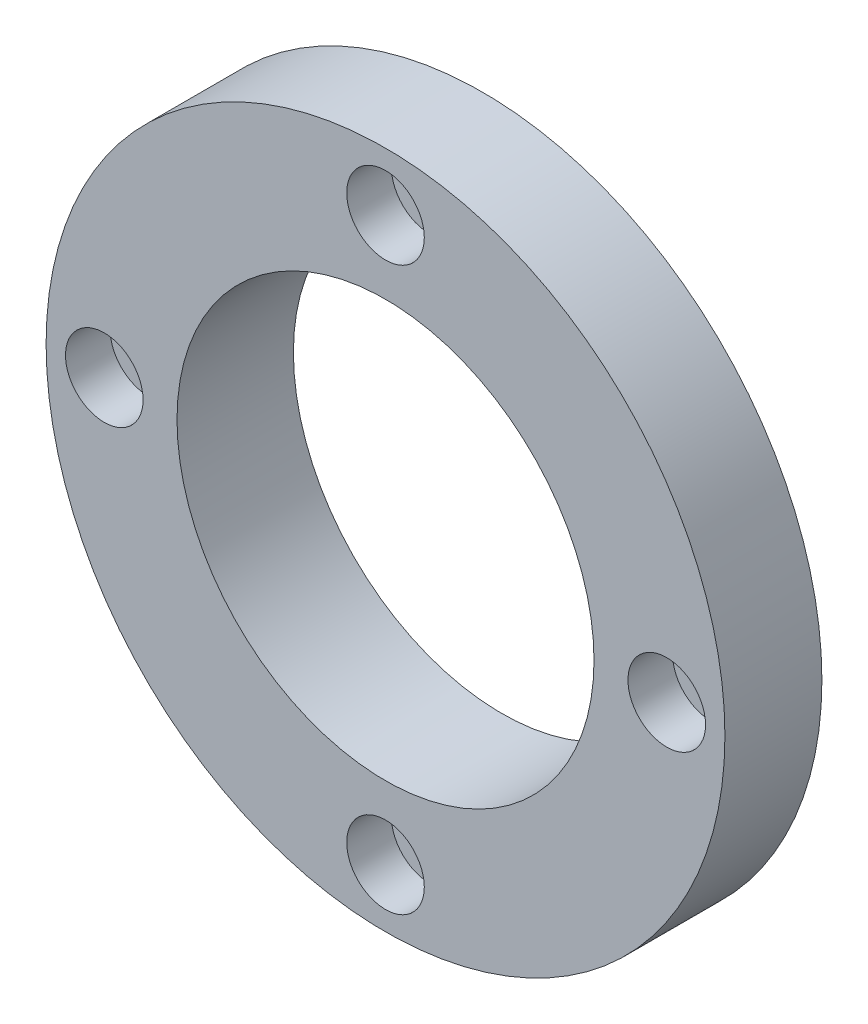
ISO-10303-21;
HEADER;
FILE_DESCRIPTION(('STEP AP214'),'2;1');
FILE_NAME('part.step','',(''),(''),'','','');
FILE_SCHEMA(('AUTOMOTIVE_DESIGN { 1 0 10303 214 1 1 1 1 }'));
ENDSEC;
DATA;
#1=APPLICATION_CONTEXT('core data for automotive mechanical design processes');
#2=APPLICATION_PROTOCOL_DEFINITION('international standard','automotive_design',2000,#1);
#3=PRODUCT_CONTEXT('',#1,'mechanical');
#4=PRODUCT('Part','Part','',(#3));
#5=PRODUCT_RELATED_PRODUCT_CATEGORY('part','',(#4));
#6=PRODUCT_DEFINITION_FORMATION('','',#4);
#7=PRODUCT_DEFINITION_CONTEXT('part definition',#1,'design');
#8=PRODUCT_DEFINITION('design','',#6,#7);
#9=PRODUCT_DEFINITION_SHAPE('','',#8);
#10=(LENGTH_UNIT() NAMED_UNIT(*) SI_UNIT(.MILLI.,.METRE.));
#11=(NAMED_UNIT(*) PLANE_ANGLE_UNIT() SI_UNIT($,.RADIAN.));
#12=(NAMED_UNIT(*) SI_UNIT($,.STERADIAN.) SOLID_ANGLE_UNIT());
#13=UNCERTAINTY_MEASURE_WITH_UNIT(LENGTH_MEASURE(1.E-05),#10,'distance_accuracy_value','');
#14=(GEOMETRIC_REPRESENTATION_CONTEXT(3) GLOBAL_UNCERTAINTY_ASSIGNED_CONTEXT((#13)) GLOBAL_UNIT_ASSIGNED_CONTEXT((#10,
#11,#12)) REPRESENTATION_CONTEXT('',''));
#15=CARTESIAN_POINT('',(0.,0.,0.));
#16=DIRECTION('',(0.,0.,1.));
#17=DIRECTION('',(1.,0.,0.));
#18=AXIS2_PLACEMENT_3D('',#15,#16,#17);
#19=CARTESIAN_POINT('',(0.,0.,0.));
#20=DIRECTION('',(0.,0.,1.));
#21=DIRECTION('',(1.,0.,0.));
#22=AXIS2_PLACEMENT_3D('',#19,#20,#21);
#23=PLANE('',#22);
#24=CARTESIAN_POINT('',(0.,29.,0.));
#25=DIRECTION('',(0.,0.,1.));
#26=DIRECTION('',(1.,0.,0.));
#27=AXIS2_PLACEMENT_3D('',#24,#25,#26);
#28=CIRCLE('',#27,2.25);
#29=CARTESIAN_POINT('',(2.25,29.,0.));
#30=VERTEX_POINT('',#29);
#31=EDGE_CURVE('E18',#30,#30,#28,.T.);
#32=ORIENTED_EDGE('',*,*,#31,.T.);
#33=EDGE_LOOP('',(#32));
#34=FACE_BOUND('',#33,.T.);
#35=CARTESIAN_POINT('',(29.0000000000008,8.20678097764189E-13,0.));
#36=DIRECTION('',(0.,0.,1.));
#37=DIRECTION('',(1.,0.,0.));
#38=AXIS2_PLACEMENT_3D('',#35,#36,#37);
#39=CIRCLE('',#38,2.25);
#40=CARTESIAN_POINT('',(31.2500000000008,8.20678097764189E-13,0.));
#41=VERTEX_POINT('',#40);
#42=EDGE_CURVE('E40',#41,#41,#39,.T.);
#43=ORIENTED_EDGE('',*,*,#42,.T.);
#44=EDGE_LOOP('',(#43));
#45=FACE_BOUND('',#44,.T.);
#46=CARTESIAN_POINT('',(1.64135619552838E-12,-29.,0.));
#47=DIRECTION('',(0.,0.,1.));
#48=DIRECTION('',(1.,0.,0.));
#49=AXIS2_PLACEMENT_3D('',#46,#47,#48);
#50=CIRCLE('',#49,2.25);
#51=CARTESIAN_POINT('',(2.25000000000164,-29.,0.));
#52=VERTEX_POINT('',#51);
#53=EDGE_CURVE('E36',#52,#52,#50,.T.);
#54=ORIENTED_EDGE('',*,*,#53,.T.);
#55=EDGE_LOOP('',(#54));
#56=FACE_BOUND('',#55,.T.);
#57=CARTESIAN_POINT('',(-28.9999999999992,-8.17126622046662E-13,0.));
#58=DIRECTION('',(0.,0.,1.));
#59=DIRECTION('',(1.,0.,0.));
#60=AXIS2_PLACEMENT_3D('',#57,#58,#59);
#61=CIRCLE('',#60,2.25);
#62=CARTESIAN_POINT('',(-26.7499999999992,-8.17126622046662E-13,0.));
#63=VERTEX_POINT('',#62);
#64=EDGE_CURVE('E31',#63,#63,#61,.T.);
#65=ORIENTED_EDGE('',*,*,#64,.T.);
#66=EDGE_LOOP('',(#65));
#67=FACE_BOUND('',#66,.T.);
#68=CARTESIAN_POINT('',(0.,0.,0.));
#69=DIRECTION('',(0.,0.,1.));
#70=DIRECTION('',(1.,0.,0.));
#71=AXIS2_PLACEMENT_3D('',#68,#69,#70);
#72=CIRCLE('',#71,35.);
#73=CARTESIAN_POINT('',(35.,0.,0.));
#74=VERTEX_POINT('',#73);
#75=EDGE_CURVE('E27',#74,#74,#72,.T.);
#76=ORIENTED_EDGE('',*,*,#75,.F.);
#77=EDGE_LOOP('',(#76));
#78=FACE_BOUND('',#77,.T.);
#79=CARTESIAN_POINT('',(0.,0.,0.));
#80=DIRECTION('',(0.,0.,1.));
#81=DIRECTION('',(1.,0.,0.));
#82=AXIS2_PLACEMENT_3D('',#79,#80,#81);
#83=CIRCLE('',#82,23.5);
#84=CARTESIAN_POINT('',(23.5,0.,0.));
#85=VERTEX_POINT('',#84);
#86=EDGE_CURVE('E10',#85,#85,#83,.F.);
#87=ORIENTED_EDGE('',*,*,#86,.F.);
#88=EDGE_LOOP('',(#87));
#89=FACE_BOUND('',#88,.T.);
#90=ADVANCED_FACE('F14',(#34,#45,#56,#67,#78,#89),#23,.F.);
#91=CARTESIAN_POINT('',(0.,0.,10.));
#92=DIRECTION('',(0.,0.,1.));
#93=DIRECTION('',(1.,0.,0.));
#94=AXIS2_PLACEMENT_3D('',#91,#92,#93);
#95=PLANE('',#94);
#96=CARTESIAN_POINT('',(0.,29.,10.));
#97=DIRECTION('',(0.,0.,1.));
#98=DIRECTION('',(1.,0.,0.));
#99=AXIS2_PLACEMENT_3D('',#96,#97,#98);
#100=CIRCLE('',#99,4.);
#101=CARTESIAN_POINT('',(4.,29.,10.));
#102=VERTEX_POINT('',#101);
#103=EDGE_CURVE('E162',#102,#102,#100,.T.);
#104=ORIENTED_EDGE('',*,*,#103,.F.);
#105=EDGE_LOOP('',(#104));
#106=FACE_BOUND('',#105,.T.);
#107=CARTESIAN_POINT('',(29.0000000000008,8.20678097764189E-13,10.));
#108=DIRECTION('',(0.,0.,1.));
#109=DIRECTION('',(1.,0.,0.));
#110=AXIS2_PLACEMENT_3D('',#107,#108,#109);
#111=CIRCLE('',#110,4.);
#112=CARTESIAN_POINT('',(33.0000000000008,8.20678097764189E-13,10.));
#113=VERTEX_POINT('',#112);
#114=EDGE_CURVE('E55',#113,#113,#111,.T.);
#115=ORIENTED_EDGE('',*,*,#114,.F.);
#116=EDGE_LOOP('',(#115));
#117=FACE_BOUND('',#116,.T.);
#118=CARTESIAN_POINT('',(1.64135619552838E-12,-29.,10.));
#119=DIRECTION('',(0.,0.,1.));
#120=DIRECTION('',(1.,0.,0.));
#121=AXIS2_PLACEMENT_3D('',#118,#119,#120);
#122=CIRCLE('',#121,4.);
#123=CARTESIAN_POINT('',(4.00000000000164,-29.,10.));
#124=VERTEX_POINT('',#123);
#125=EDGE_CURVE('E42',#124,#124,#122,.T.);
#126=ORIENTED_EDGE('',*,*,#125,.F.);
#127=EDGE_LOOP('',(#126));
#128=FACE_BOUND('',#127,.T.);
#129=CARTESIAN_POINT('',(-28.9999999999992,-8.17126622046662E-13,10.));
#130=DIRECTION('',(0.,0.,1.));
#131=DIRECTION('',(1.,0.,0.));
#132=AXIS2_PLACEMENT_3D('',#129,#130,#131);
#133=CIRCLE('',#132,4.);
#134=CARTESIAN_POINT('',(-24.9999999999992,-8.17126622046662E-13,10.));
#135=VERTEX_POINT('',#134);
#136=EDGE_CURVE('E38',#135,#135,#133,.T.);
#137=ORIENTED_EDGE('',*,*,#136,.F.);
#138=EDGE_LOOP('',(#137));
#139=FACE_BOUND('',#138,.T.);
#140=CARTESIAN_POINT('',(0.,0.,10.));
#141=DIRECTION('',(0.,0.,1.));
#142=DIRECTION('',(1.,0.,0.));
#143=AXIS2_PLACEMENT_3D('',#140,#141,#142);
#144=CIRCLE('',#143,35.);
#145=CARTESIAN_POINT('',(35.,0.,10.));
#146=VERTEX_POINT('',#145);
#147=EDGE_CURVE('E22',#146,#146,#144,.T.);
#148=ORIENTED_EDGE('',*,*,#147,.T.);
#149=EDGE_LOOP('',(#148));
#150=FACE_BOUND('',#149,.T.);
#151=CARTESIAN_POINT('',(0.,0.,10.));
#152=DIRECTION('',(0.,0.,1.));
#153=DIRECTION('',(1.,0.,0.));
#154=AXIS2_PLACEMENT_3D('',#151,#152,#153);
#155=CIRCLE('',#154,21.5);
#156=CARTESIAN_POINT('',(21.5,0.,10.));
#157=VERTEX_POINT('',#156);
#158=EDGE_CURVE('E75',#157,#157,#155,.T.);
#159=ORIENTED_EDGE('',*,*,#158,.F.);
#160=EDGE_LOOP('',(#159));
#161=FACE_BOUND('',#160,.T.);
#162=ADVANCED_FACE('F85',(#106,#117,#128,#139,#150,#161),#95,.T.);
#163=CARTESIAN_POINT('',(0.,0.,10.));
#164=DIRECTION('',(0.,0.,-1.));
#165=DIRECTION('',(-1.,0.,0.));
#166=AXIS2_PLACEMENT_3D('',#163,#164,#165);
#167=CYLINDRICAL_SURFACE('',#166,35.);
#168=ORIENTED_EDGE('',*,*,#147,.F.);
#169=EDGE_LOOP('',(#168));
#170=FACE_BOUND('',#169,.T.);
#171=ORIENTED_EDGE('',*,*,#75,.T.);
#172=EDGE_LOOP('',(#171));
#173=FACE_BOUND('',#172,.T.);
#174=ADVANCED_FACE('F16',(#170,#173),#167,.T.);
#175=CARTESIAN_POINT('',(0.,0.,10.));
#176=DIRECTION('',(0.,0.,-1.));
#177=DIRECTION('',(-1.,0.,0.));
#178=AXIS2_PLACEMENT_3D('',#175,#176,#177);
#179=CYLINDRICAL_SURFACE('',#178,21.5);
#180=ORIENTED_EDGE('',*,*,#158,.T.);
#181=EDGE_LOOP('',(#180));
#182=FACE_BOUND('',#181,.T.);
#183=CARTESIAN_POINT('',(0.,0.,-2.));
#184=DIRECTION('',(0.,0.,-1.));
#185=DIRECTION('',(-1.,0.,0.));
#186=AXIS2_PLACEMENT_3D('',#183,#184,#185);
#187=CIRCLE('',#186,21.5);
#188=CARTESIAN_POINT('',(-21.5,0.,-2.));
#189=VERTEX_POINT('',#188);
#190=EDGE_CURVE('E34',#189,#189,#187,.T.);
#191=ORIENTED_EDGE('',*,*,#190,.T.);
#192=EDGE_LOOP('',(#191));
#193=FACE_BOUND('',#192,.T.);
#194=ADVANCED_FACE('F96',(#182,#193),#179,.F.);
#195=CARTESIAN_POINT('',(0.,0.,-2.));
#196=DIRECTION('',(0.,0.,-1.));
#197=DIRECTION('',(-1.,0.,0.));
#198=AXIS2_PLACEMENT_3D('',#195,#196,#197);
#199=PLANE('',#198);
#200=CARTESIAN_POINT('',(0.,0.,-2.));
#201=DIRECTION('',(0.,0.,-1.));
#202=DIRECTION('',(-1.,0.,0.));
#203=AXIS2_PLACEMENT_3D('',#200,#201,#202);
#204=CIRCLE('',#203,23.5);
#205=CARTESIAN_POINT('',(-23.5,0.,-2.));
#206=VERTEX_POINT('',#205);
#207=EDGE_CURVE('E72',#206,#206,#204,.T.);
#208=ORIENTED_EDGE('',*,*,#207,.T.);
#209=EDGE_LOOP('',(#208));
#210=FACE_BOUND('',#209,.T.);
#211=ORIENTED_EDGE('',*,*,#190,.F.);
#212=EDGE_LOOP('',(#211));
#213=FACE_BOUND('',#212,.T.);
#214=ADVANCED_FACE('F99',(#210,#213),#199,.T.);
#215=CARTESIAN_POINT('',(0.,0.,-2.));
#216=DIRECTION('',(0.,0.,1.));
#217=DIRECTION('',(1.,0.,0.));
#218=AXIS2_PLACEMENT_3D('',#215,#216,#217);
#219=CYLINDRICAL_SURFACE('',#218,23.5);
#220=ORIENTED_EDGE('',*,*,#207,.F.);
#221=EDGE_LOOP('',(#220));
#222=FACE_BOUND('',#221,.T.);
#223=ORIENTED_EDGE('',*,*,#86,.T.);
#224=EDGE_LOOP('',(#223));
#225=FACE_BOUND('',#224,.T.);
#226=ADVANCED_FACE('F100',(#222,#225),#219,.T.);
#227=CARTESIAN_POINT('',(-28.9999999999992,-8.17126622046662E-13,10.));
#228=DIRECTION('',(0.,0.,1.));
#229=DIRECTION('',(1.,0.,0.));
#230=AXIS2_PLACEMENT_3D('',#227,#228,#229);
#231=CYLINDRICAL_SURFACE('',#230,2.25);
#232=CARTESIAN_POINT('',(-28.9999999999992,-8.17126622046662E-13,5.4));
#233=DIRECTION('',(0.,0.,1.));
#234=DIRECTION('',(1.,0.,0.));
#235=AXIS2_PLACEMENT_3D('',#232,#233,#234);
#236=CIRCLE('',#235,2.25);
#237=CARTESIAN_POINT('',(-26.7499999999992,-8.17126622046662E-13,5.4));
#238=VERTEX_POINT('',#237);
#239=EDGE_CURVE('E35',#238,#238,#236,.T.);
#240=ORIENTED_EDGE('',*,*,#239,.T.);
#241=EDGE_LOOP('',(#240));
#242=FACE_BOUND('',#241,.T.);
#243=ORIENTED_EDGE('',*,*,#64,.F.);
#244=EDGE_LOOP('',(#243));
#245=FACE_BOUND('',#244,.T.);
#246=ADVANCED_FACE('F103',(#242,#245),#231,.F.);
#247=CARTESIAN_POINT('',(-26.7499999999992,-8.17126622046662E-13,5.4));
#248=DIRECTION('',(0.,0.,-1.));
#249=DIRECTION('',(-1.,0.,0.));
#250=AXIS2_PLACEMENT_3D('',#247,#248,#249);
#251=PLANE('',#250);
#252=ORIENTED_EDGE('',*,*,#239,.F.);
#253=EDGE_LOOP('',(#252));
#254=FACE_BOUND('',#253,.T.);
#255=CARTESIAN_POINT('',(-28.9999999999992,-8.17126622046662E-13,5.4));
#256=DIRECTION('',(0.,0.,1.));
#257=DIRECTION('',(1.,0.,0.));
#258=AXIS2_PLACEMENT_3D('',#255,#256,#257);
#259=CIRCLE('',#258,4.);
#260=CARTESIAN_POINT('',(-24.9999999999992,-8.17126622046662E-13,5.4));
#261=VERTEX_POINT('',#260);
#262=EDGE_CURVE('E65',#261,#261,#259,.T.);
#263=ORIENTED_EDGE('',*,*,#262,.T.);
#264=EDGE_LOOP('',(#263));
#265=FACE_BOUND('',#264,.T.);
#266=ADVANCED_FACE('F110',(#254,#265),#251,.F.);
#267=CARTESIAN_POINT('',(-28.9999999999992,-8.17126622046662E-13,10.));
#268=DIRECTION('',(0.,0.,1.));
#269=DIRECTION('',(1.,0.,0.));
#270=AXIS2_PLACEMENT_3D('',#267,#268,#269);
#271=CYLINDRICAL_SURFACE('',#270,4.);
#272=ORIENTED_EDGE('',*,*,#262,.F.);
#273=EDGE_LOOP('',(#272));
#274=FACE_BOUND('',#273,.T.);
#275=ORIENTED_EDGE('',*,*,#136,.T.);
#276=EDGE_LOOP('',(#275));
#277=FACE_BOUND('',#276,.T.);
#278=ADVANCED_FACE('F114',(#274,#277),#271,.F.);
#279=CARTESIAN_POINT('',(1.64135619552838E-12,-29.,10.));
#280=DIRECTION('',(0.,0.,1.));
#281=DIRECTION('',(1.,0.,0.));
#282=AXIS2_PLACEMENT_3D('',#279,#280,#281);
#283=CYLINDRICAL_SURFACE('',#282,2.25);
#284=CARTESIAN_POINT('',(1.64135619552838E-12,-29.,5.4));
#285=DIRECTION('',(0.,0.,1.));
#286=DIRECTION('',(1.,0.,0.));
#287=AXIS2_PLACEMENT_3D('',#284,#285,#286);
#288=CIRCLE('',#287,2.25);
#289=CARTESIAN_POINT('',(2.25000000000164,-29.,5.4));
#290=VERTEX_POINT('',#289);
#291=EDGE_CURVE('E39',#290,#290,#288,.T.);
#292=ORIENTED_EDGE('',*,*,#291,.T.);
#293=EDGE_LOOP('',(#292));
#294=FACE_BOUND('',#293,.T.);
#295=ORIENTED_EDGE('',*,*,#53,.F.);
#296=EDGE_LOOP('',(#295));
#297=FACE_BOUND('',#296,.T.);
#298=ADVANCED_FACE('F118',(#294,#297),#283,.F.);
#299=CARTESIAN_POINT('',(2.25000000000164,-29.,5.4));
#300=DIRECTION('',(0.,0.,-1.));
#301=DIRECTION('',(-1.,0.,0.));
#302=AXIS2_PLACEMENT_3D('',#299,#300,#301);
#303=PLANE('',#302);
#304=ORIENTED_EDGE('',*,*,#291,.F.);
#305=EDGE_LOOP('',(#304));
#306=FACE_BOUND('',#305,.T.);
#307=CARTESIAN_POINT('',(1.64135619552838E-12,-29.,5.4));
#308=DIRECTION('',(0.,0.,1.));
#309=DIRECTION('',(1.,0.,0.));
#310=AXIS2_PLACEMENT_3D('',#307,#308,#309);
#311=CIRCLE('',#310,4.);
#312=CARTESIAN_POINT('',(4.00000000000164,-29.,5.4));
#313=VERTEX_POINT('',#312);
#314=EDGE_CURVE('E47',#313,#313,#311,.T.);
#315=ORIENTED_EDGE('',*,*,#314,.T.);
#316=EDGE_LOOP('',(#315));
#317=FACE_BOUND('',#316,.T.);
#318=ADVANCED_FACE('F122',(#306,#317),#303,.F.);
#319=CARTESIAN_POINT('',(1.64135619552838E-12,-29.,10.));
#320=DIRECTION('',(0.,0.,1.));
#321=DIRECTION('',(1.,0.,0.));
#322=AXIS2_PLACEMENT_3D('',#319,#320,#321);
#323=CYLINDRICAL_SURFACE('',#322,4.);
#324=ORIENTED_EDGE('',*,*,#314,.F.);
#325=EDGE_LOOP('',(#324));
#326=FACE_BOUND('',#325,.T.);
#327=ORIENTED_EDGE('',*,*,#125,.T.);
#328=EDGE_LOOP('',(#327));
#329=FACE_BOUND('',#328,.T.);
#330=ADVANCED_FACE('F126',(#326,#329),#323,.F.);
#331=CARTESIAN_POINT('',(29.0000000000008,8.20678097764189E-13,10.));
#332=DIRECTION('',(0.,0.,1.));
#333=DIRECTION('',(1.,0.,0.));
#334=AXIS2_PLACEMENT_3D('',#331,#332,#333);
#335=CYLINDRICAL_SURFACE('',#334,2.25);
#336=CARTESIAN_POINT('',(29.0000000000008,8.20678097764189E-13,5.4));
#337=DIRECTION('',(0.,0.,1.));
#338=DIRECTION('',(1.,0.,0.));
#339=AXIS2_PLACEMENT_3D('',#336,#337,#338);
#340=CIRCLE('',#339,2.25);
#341=CARTESIAN_POINT('',(31.2500000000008,8.20678097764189E-13,5.4));
#342=VERTEX_POINT('',#341);
#343=EDGE_CURVE('E43',#342,#342,#340,.T.);
#344=ORIENTED_EDGE('',*,*,#343,.T.);
#345=EDGE_LOOP('',(#344));
#346=FACE_BOUND('',#345,.T.);
#347=ORIENTED_EDGE('',*,*,#42,.F.);
#348=EDGE_LOOP('',(#347));
#349=FACE_BOUND('',#348,.T.);
#350=ADVANCED_FACE('F130',(#346,#349),#335,.F.);
#351=CARTESIAN_POINT('',(31.2500000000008,8.20678097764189E-13,5.4));
#352=DIRECTION('',(0.,0.,-1.));
#353=DIRECTION('',(-1.,0.,0.));
#354=AXIS2_PLACEMENT_3D('',#351,#352,#353);
#355=PLANE('',#354);
#356=ORIENTED_EDGE('',*,*,#343,.F.);
#357=EDGE_LOOP('',(#356));
#358=FACE_BOUND('',#357,.T.);
#359=CARTESIAN_POINT('',(29.0000000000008,8.20678097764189E-13,5.4));
#360=DIRECTION('',(0.,0.,1.));
#361=DIRECTION('',(1.,0.,0.));
#362=AXIS2_PLACEMENT_3D('',#359,#360,#361);
#363=CIRCLE('',#362,4.);
#364=CARTESIAN_POINT('',(33.0000000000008,8.20678097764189E-13,5.4));
#365=VERTEX_POINT('',#364);
#366=EDGE_CURVE('E50',#365,#365,#363,.T.);
#367=ORIENTED_EDGE('',*,*,#366,.T.);
#368=EDGE_LOOP('',(#367));
#369=FACE_BOUND('',#368,.T.);
#370=ADVANCED_FACE('F134',(#358,#369),#355,.F.);
#371=CARTESIAN_POINT('',(29.0000000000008,8.20678097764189E-13,10.));
#372=DIRECTION('',(0.,0.,1.));
#373=DIRECTION('',(1.,0.,0.));
#374=AXIS2_PLACEMENT_3D('',#371,#372,#373);
#375=CYLINDRICAL_SURFACE('',#374,4.);
#376=ORIENTED_EDGE('',*,*,#366,.F.);
#377=EDGE_LOOP('',(#376));
#378=FACE_BOUND('',#377,.T.);
#379=ORIENTED_EDGE('',*,*,#114,.T.);
#380=EDGE_LOOP('',(#379));
#381=FACE_BOUND('',#380,.T.);
#382=ADVANCED_FACE('F137',(#378,#381),#375,.F.);
#383=CARTESIAN_POINT('',(0.,29.,10.));
#384=DIRECTION('',(0.,0.,1.));
#385=DIRECTION('',(1.,0.,0.));
#386=AXIS2_PLACEMENT_3D('',#383,#384,#385);
#387=CYLINDRICAL_SURFACE('',#386,2.25);
#388=CARTESIAN_POINT('',(0.,29.,5.4));
#389=DIRECTION('',(0.,0.,1.));
#390=DIRECTION('',(1.,0.,0.));
#391=AXIS2_PLACEMENT_3D('',#388,#389,#390);
#392=CIRCLE('',#391,2.25);
#393=CARTESIAN_POINT('',(2.25,29.,5.4));
#394=VERTEX_POINT('',#393);
#395=EDGE_CURVE('E164',#394,#394,#392,.T.);
#396=ORIENTED_EDGE('',*,*,#395,.T.);
#397=EDGE_LOOP('',(#396));
#398=FACE_BOUND('',#397,.T.);
#399=ORIENTED_EDGE('',*,*,#31,.F.);
#400=EDGE_LOOP('',(#399));
#401=FACE_BOUND('',#400,.T.);
#402=ADVANCED_FACE('F141',(#398,#401),#387,.F.);
#403=CARTESIAN_POINT('',(2.25,29.,5.4));
#404=DIRECTION('',(0.,0.,-1.));
#405=DIRECTION('',(-1.,0.,0.));
#406=AXIS2_PLACEMENT_3D('',#403,#404,#405);
#407=PLANE('',#406);
#408=ORIENTED_EDGE('',*,*,#395,.F.);
#409=EDGE_LOOP('',(#408));
#410=FACE_BOUND('',#409,.T.);
#411=CARTESIAN_POINT('',(0.,29.,5.4));
#412=DIRECTION('',(0.,0.,1.));
#413=DIRECTION('',(1.,0.,0.));
#414=AXIS2_PLACEMENT_3D('',#411,#412,#413);
#415=CIRCLE('',#414,4.);
#416=CARTESIAN_POINT('',(4.,29.,5.4));
#417=VERTEX_POINT('',#416);
#418=EDGE_CURVE('E159',#417,#417,#415,.T.);
#419=ORIENTED_EDGE('',*,*,#418,.T.);
#420=EDGE_LOOP('',(#419));
#421=FACE_BOUND('',#420,.T.);
#422=ADVANCED_FACE('F145',(#410,#421),#407,.F.);
#423=CARTESIAN_POINT('',(0.,29.,10.));
#424=DIRECTION('',(0.,0.,1.));
#425=DIRECTION('',(1.,0.,0.));
#426=AXIS2_PLACEMENT_3D('',#423,#424,#425);
#427=CYLINDRICAL_SURFACE('',#426,4.);
#428=ORIENTED_EDGE('',*,*,#418,.F.);
#429=EDGE_LOOP('',(#428));
#430=FACE_BOUND('',#429,.T.);
#431=ORIENTED_EDGE('',*,*,#103,.T.);
#432=EDGE_LOOP('',(#431));
#433=FACE_BOUND('',#432,.T.);
#434=ADVANCED_FACE('F149',(#430,#433),#427,.F.);
#435=CLOSED_SHELL('',(#90,#162,#174,#194,#214,#226,#246,#266,#278,#298,#318,#330,#350,#370,#382,
#402,#422,#434));
#436=MANIFOLD_SOLID_BREP('B1',#435);
#437=ADVANCED_BREP_SHAPE_REPRESENTATION('',(#18,#436),#14);
#438=SHAPE_DEFINITION_REPRESENTATION(#9,#437);
ENDSEC;
END-ISO-10303-21;
